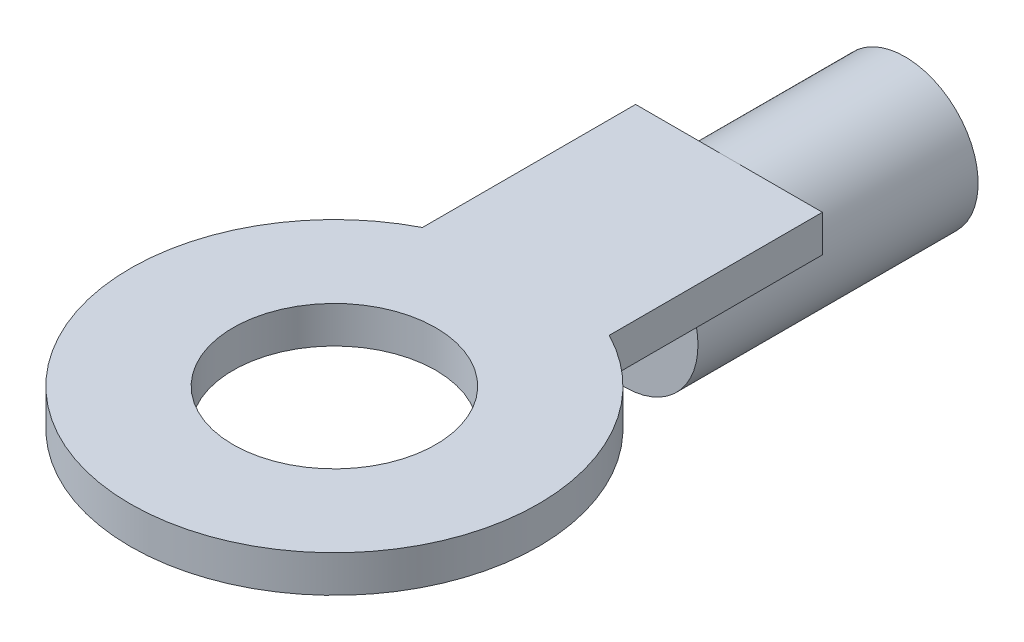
ISO-10303-21;
HEADER;
FILE_DESCRIPTION(('STEP AP214'),'2;1');
FILE_NAME('part.step','',(''),(''),'','','');
FILE_SCHEMA(('AUTOMOTIVE_DESIGN { 1 0 10303 214 1 1 1 1 }'));
ENDSEC;
DATA;
#1=APPLICATION_CONTEXT('core data for automotive mechanical design processes');
#2=APPLICATION_PROTOCOL_DEFINITION('international standard','automotive_design',2000,#1);
#3=PRODUCT_CONTEXT('',#1,'mechanical');
#4=PRODUCT('Part','Part','',(#3));
#5=PRODUCT_RELATED_PRODUCT_CATEGORY('part','',(#4));
#6=PRODUCT_DEFINITION_FORMATION('','',#4);
#7=PRODUCT_DEFINITION_CONTEXT('part definition',#1,'design');
#8=PRODUCT_DEFINITION('design','',#6,#7);
#9=PRODUCT_DEFINITION_SHAPE('','',#8);
#10=(LENGTH_UNIT() NAMED_UNIT(*) SI_UNIT(.MILLI.,.METRE.));
#11=(NAMED_UNIT(*) PLANE_ANGLE_UNIT() SI_UNIT($,.RADIAN.));
#12=(NAMED_UNIT(*) SI_UNIT($,.STERADIAN.) SOLID_ANGLE_UNIT());
#13=UNCERTAINTY_MEASURE_WITH_UNIT(LENGTH_MEASURE(1.E-05),#10,'distance_accuracy_value','');
#14=(GEOMETRIC_REPRESENTATION_CONTEXT(3) GLOBAL_UNCERTAINTY_ASSIGNED_CONTEXT((#13)) GLOBAL_UNIT_ASSIGNED_CONTEXT((#10,
#11,#12)) REPRESENTATION_CONTEXT('',''));
#15=CARTESIAN_POINT('',(0.,0.,0.));
#16=DIRECTION('',(0.,0.,1.));
#17=DIRECTION('',(1.,0.,0.));
#18=AXIS2_PLACEMENT_3D('',#15,#16,#17);
#19=CARTESIAN_POINT('',(0.,-36.565,7.33));
#20=DIRECTION('',(0.,0.,-1.));
#21=DIRECTION('',(-1.,0.,0.));
#22=AXIS2_PLACEMENT_3D('',#19,#20,#21);
#23=CYLINDRICAL_SURFACE('',#22,0.775);
#24=CARTESIAN_POINT('',(0.,-36.565,7.33));
#25=DIRECTION('',(0.,0.,-1.));
#26=DIRECTION('',(-1.,0.,0.));
#27=AXIS2_PLACEMENT_3D('',#24,#25,#26);
#28=CIRCLE('',#27,0.775);
#29=CARTESIAN_POINT('',(-2.67147183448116E-08,-35.79,7.33));
#30=VERTEX_POINT('',#29);
#31=CARTESIAN_POINT('',(-0.775,-36.565,7.33));
#32=VERTEX_POINT('',#31);
#33=EDGE_CURVE('E58',#30,#32,#28,.T.);
#34=ORIENTED_EDGE('',*,*,#33,.F.);
#35=CARTESIAN_POINT('',(0.,-36.565,7.33));
#36=DIRECTION('',(0.,0.,-1.));
#37=DIRECTION('',(-1.,0.,0.));
#38=AXIS2_PLACEMENT_3D('',#35,#36,#37);
#39=CIRCLE('',#38,0.775);
#40=EDGE_CURVE('E20',#32,#30,#39,.T.);
#41=ORIENTED_EDGE('',*,*,#40,.F.);
#42=DIRECTION('',(0.,0.,-1.));
#43=VECTOR('',#42,1.);
#44=CARTESIAN_POINT('',(-0.775,-36.565,7.33));
#45=LINE('',#44,#43);
#46=CARTESIAN_POINT('',(-0.775,-36.565,1.33));
#47=VERTEX_POINT('',#46);
#48=EDGE_CURVE('E133',#32,#47,#45,.T.);
#49=ORIENTED_EDGE('',*,*,#48,.T.);
#50=CARTESIAN_POINT('',(0.,-36.565,1.33));
#51=DIRECTION('',(0.,0.,-1.));
#52=DIRECTION('',(-1.,0.,0.));
#53=AXIS2_PLACEMENT_3D('',#50,#51,#52);
#54=CIRCLE('',#53,0.775);
#55=EDGE_CURVE('E135',#47,#47,#54,.T.);
#56=ORIENTED_EDGE('',*,*,#55,.T.);
#57=ORIENTED_EDGE('',*,*,#48,.F.);
#58=EDGE_LOOP('',(#34,#41,#49,#56,#57));
#59=FACE_BOUND('',#58,.T.);
#60=ADVANCED_FACE('F16',(#59),#23,.F.);
#61=CARTESIAN_POINT('',(0.,-36.565,1.33));
#62=DIRECTION('',(0.,0.,-1.));
#63=DIRECTION('',(0.,-1.,0.));
#64=AXIS2_PLACEMENT_3D('',#61,#62,#63);
#65=PLANE('',#64);
#66=ORIENTED_EDGE('',*,*,#55,.F.);
#67=EDGE_LOOP('',(#66));
#68=FACE_BOUND('',#67,.T.);
#69=CARTESIAN_POINT('',(0.,-36.565,1.33));
#70=DIRECTION('',(0.,0.,-1.));
#71=DIRECTION('',(-1.,0.,0.));
#72=AXIS2_PLACEMENT_3D('',#69,#70,#71);
#73=CIRCLE('',#72,1.565);
#74=CARTESIAN_POINT('',(-1.565,-36.565,1.33));
#75=VERTEX_POINT('',#74);
#76=EDGE_CURVE('E141',#75,#75,#73,.T.);
#77=ORIENTED_EDGE('',*,*,#76,.T.);
#78=EDGE_LOOP('',(#77));
#79=FACE_BOUND('',#78,.T.);
#80=ADVANCED_FACE('F138',(#68,#79),#65,.T.);
#81=CARTESIAN_POINT('',(0.,-35.79,13.55));
#82=DIRECTION('',(0.,1.,0.));
#83=DIRECTION('',(1.,0.,0.));
#84=AXIS2_PLACEMENT_3D('',#81,#82,#83);
#85=PLANE('',#84);
#86=CARTESIAN_POINT('',(0.,-35.79,13.55));
#87=DIRECTION('',(0.,1.,0.));
#88=DIRECTION('',(0.,0.,-1.));
#89=AXIS2_PLACEMENT_3D('',#86,#87,#88);
#90=CIRCLE('',#89,2.17);
#91=CARTESIAN_POINT('',(0.,-35.79,11.38));
#92=VERTEX_POINT('',#91);
#93=EDGE_CURVE('E146',#92,#92,#90,.T.);
#94=ORIENTED_EDGE('',*,*,#93,.T.);
#95=EDGE_LOOP('',(#94));
#96=FACE_BOUND('',#95,.T.);
#97=DIRECTION('',(-1.,0.,0.));
#98=VECTOR('',#97,1.);
#99=CARTESIAN_POINT('',(2.,-35.79,5.1));
#100=LINE('',#99,#98);
#101=CARTESIAN_POINT('',(-1.359632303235,-35.79,5.1));
#102=VERTEX_POINT('',#101);
#103=CARTESIAN_POINT('',(-2.,-35.79,5.1));
#104=VERTEX_POINT('',#103);
#105=EDGE_CURVE('E155',#102,#104,#100,.T.);
#106=ORIENTED_EDGE('',*,*,#105,.F.);
#107=DIRECTION('',(0.,0.,-1.));
#108=VECTOR('',#107,1.);
#109=CARTESIAN_POINT('',(-1.359632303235,-35.79,7.33));
#110=LINE('',#109,#108);
#111=CARTESIAN_POINT('',(-1.359632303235,-35.79,7.33));
#112=VERTEX_POINT('',#111);
#113=EDGE_CURVE('E158',#112,#102,#110,.T.);
#114=ORIENTED_EDGE('',*,*,#113,.F.);
#115=CARTESIAN_POINT('',(-2.67147183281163E-08,-35.79,7.33));
#116=CARTESIAN_POINT('',(-1.359632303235,-35.79,7.33));
#117=B_SPLINE_CURVE_WITH_KNOTS('',1,(#115,#116),.UNSPECIFIED.,.F.,.F.,(2,2),(0.,1.),.UNSPECIFIED.);
#118=EDGE_CURVE('E10',#30,#112,#117,.T.);
#119=ORIENTED_EDGE('',*,*,#118,.F.);
#120=CARTESIAN_POINT('',(1.359632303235,-35.79,7.33));
#121=CARTESIAN_POINT('',(-2.67147183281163E-08,-35.79,7.33));
#122=B_SPLINE_CURVE_WITH_KNOTS('',1,(#120,#121),.UNSPECIFIED.,.F.,.F.,(2,2),(0.,1.),.UNSPECIFIED.);
#123=CARTESIAN_POINT('',(1.35963230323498,-35.79,7.33));
#124=VERTEX_POINT('',#123);
#125=EDGE_CURVE('E233',#124,#30,#122,.T.);
#126=ORIENTED_EDGE('',*,*,#125,.F.);
#127=DIRECTION('',(0.,0.,-1.));
#128=VECTOR('',#127,1.);
#129=CARTESIAN_POINT('',(1.359632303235,-35.79,7.33));
#130=LINE('',#129,#128);
#131=CARTESIAN_POINT('',(1.359632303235,-35.79,5.1));
#132=VERTEX_POINT('',#131);
#133=EDGE_CURVE('E164',#124,#132,#130,.T.);
#134=ORIENTED_EDGE('',*,*,#133,.T.);
#135=DIRECTION('',(-1.,0.,0.));
#136=VECTOR('',#135,1.);
#137=CARTESIAN_POINT('',(2.,-35.79,5.1));
#138=LINE('',#137,#136);
#139=CARTESIAN_POINT('',(2.,-35.79,5.1));
#140=VERTEX_POINT('',#139);
#141=EDGE_CURVE('E159',#140,#132,#138,.T.);
#142=ORIENTED_EDGE('',*,*,#141,.F.);
#143=DIRECTION('',(0.,0.,-1.));
#144=VECTOR('',#143,1.);
#145=CARTESIAN_POINT('',(2.,-35.79,10.6));
#146=LINE('',#145,#144);
#147=CARTESIAN_POINT('',(2.,-35.79,9.664527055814));
#148=VERTEX_POINT('',#147);
#149=EDGE_CURVE('E163',#148,#140,#146,.T.);
#150=ORIENTED_EDGE('',*,*,#149,.F.);
#151=CARTESIAN_POINT('',(0.,-35.79,13.55));
#152=DIRECTION('',(0.,1.,0.));
#153=DIRECTION('',(0.,0.,-1.));
#154=AXIS2_PLACEMENT_3D('',#151,#152,#153);
#155=CIRCLE('',#154,4.37);
#156=CARTESIAN_POINT('',(-2.,-35.79,9.664527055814));
#157=VERTEX_POINT('',#156);
#158=EDGE_CURVE('E168',#157,#148,#155,.T.);
#159=ORIENTED_EDGE('',*,*,#158,.F.);
#160=DIRECTION('',(0.,0.,-1.));
#161=VECTOR('',#160,1.);
#162=CARTESIAN_POINT('',(-2.,-35.79,10.6));
#163=LINE('',#162,#161);
#164=EDGE_CURVE('E172',#157,#104,#163,.T.);
#165=ORIENTED_EDGE('',*,*,#164,.T.);
#166=EDGE_LOOP('',(#106,#114,#119,#126,#134,#142,#150,#159,#165));
#167=FACE_BOUND('',#166,.T.);
#168=ADVANCED_FACE('F242',(#96,#167),#85,.F.);
#169=CARTESIAN_POINT('',(0.,-35.79,13.55));
#170=DIRECTION('',(0.,1.,0.));
#171=DIRECTION('',(0.,0.,-1.));
#172=AXIS2_PLACEMENT_3D('',#169,#170,#171);
#173=CYLINDRICAL_SURFACE('',#172,2.17);
#174=DIRECTION('',(0.,1.,0.));
#175=VECTOR('',#174,1.);
#176=CARTESIAN_POINT('',(0.,-35.79,11.38));
#177=LINE('',#176,#175);
#178=CARTESIAN_POINT('',(0.,-35.,11.38));
#179=VERTEX_POINT('',#178);
#180=EDGE_CURVE('E176',#92,#179,#177,.T.);
#181=ORIENTED_EDGE('',*,*,#180,.F.);
#182=ORIENTED_EDGE('',*,*,#93,.F.);
#183=ORIENTED_EDGE('',*,*,#180,.T.);
#184=CARTESIAN_POINT('',(0.,-35.,13.55));
#185=DIRECTION('',(0.,1.,0.));
#186=DIRECTION('',(0.,0.,-1.));
#187=AXIS2_PLACEMENT_3D('',#184,#185,#186);
#188=CIRCLE('',#187,2.17);
#189=EDGE_CURVE('E179',#179,#179,#188,.T.);
#190=ORIENTED_EDGE('',*,*,#189,.T.);
#191=EDGE_LOOP('',(#181,#182,#183,#190));
#192=FACE_BOUND('',#191,.T.);
#193=ADVANCED_FACE('F272',(#192),#173,.F.);
#194=CARTESIAN_POINT('',(0.,-36.565,7.33));
#195=DIRECTION('',(0.,0.,-1.));
#196=DIRECTION('',(-1.,0.,0.));
#197=AXIS2_PLACEMENT_3D('',#194,#195,#196);
#198=CYLINDRICAL_SURFACE('',#197,1.565);
#199=DIRECTION('',(0.,0.,-1.));
#200=VECTOR('',#199,1.);
#201=CARTESIAN_POINT('',(-1.565,-36.565,7.33));
#202=LINE('',#201,#200);
#203=CARTESIAN_POINT('',(-1.565,-36.565,7.33));
#204=VERTEX_POINT('',#203);
#205=EDGE_CURVE('E183',#204,#75,#202,.T.);
#206=ORIENTED_EDGE('',*,*,#205,.T.);
#207=ORIENTED_EDGE('',*,*,#76,.F.);
#208=ORIENTED_EDGE('',*,*,#205,.F.);
#209=CARTESIAN_POINT('',(0.,-36.565,7.33));
#210=DIRECTION('',(0.,0.,-1.));
#211=DIRECTION('',(-1.,0.,0.));
#212=AXIS2_PLACEMENT_3D('',#209,#210,#211);
#213=CIRCLE('',#212,1.565);
#214=EDGE_CURVE('E27',#204,#112,#213,.T.);
#215=ORIENTED_EDGE('',*,*,#214,.T.);
#216=ORIENTED_EDGE('',*,*,#113,.T.);
#217=CARTESIAN_POINT('',(0.,-36.565,5.1));
#218=DIRECTION('',(0.,0.,-1.));
#219=DIRECTION('',(-1.,0.,0.));
#220=AXIS2_PLACEMENT_3D('',#217,#218,#219);
#221=CIRCLE('',#220,1.565);
#222=CARTESIAN_POINT('',(0.,-35.,5.1));
#223=VERTEX_POINT('',#222);
#224=EDGE_CURVE('E184',#102,#223,#221,.T.);
#225=ORIENTED_EDGE('',*,*,#224,.T.);
#226=CARTESIAN_POINT('',(0.,-36.565,5.1));
#227=DIRECTION('',(0.,0.,-1.));
#228=DIRECTION('',(-1.,0.,0.));
#229=AXIS2_PLACEMENT_3D('',#226,#227,#228);
#230=CIRCLE('',#229,1.565);
#231=EDGE_CURVE('E187',#223,#132,#230,.T.);
#232=ORIENTED_EDGE('',*,*,#231,.T.);
#233=ORIENTED_EDGE('',*,*,#133,.F.);
#234=CARTESIAN_POINT('',(0.,-36.565,7.33));
#235=DIRECTION('',(0.,0.,-1.));
#236=DIRECTION('',(-1.,0.,0.));
#237=AXIS2_PLACEMENT_3D('',#234,#235,#236);
#238=CIRCLE('',#237,1.565);
#239=EDGE_CURVE('E230',#124,#204,#238,.T.);
#240=ORIENTED_EDGE('',*,*,#239,.T.);
#241=EDGE_LOOP('',(#206,#207,#208,#215,#216,#225,#232,#233,#240));
#242=FACE_BOUND('',#241,.T.);
#243=ADVANCED_FACE('F246',(#242),#198,.T.);
#244=CARTESIAN_POINT('',(2.,-35.,10.6));
#245=DIRECTION('',(0.,1.,0.));
#246=DIRECTION('',(1.,0.,0.));
#247=AXIS2_PLACEMENT_3D('',#244,#245,#246);
#248=PLANE('',#247);
#249=ORIENTED_EDGE('',*,*,#189,.F.);
#250=EDGE_LOOP('',(#249));
#251=FACE_BOUND('',#250,.T.);
#252=DIRECTION('',(0.,0.,-1.));
#253=VECTOR('',#252,1.);
#254=CARTESIAN_POINT('',(-2.,-35.,10.6));
#255=LINE('',#254,#253);
#256=CARTESIAN_POINT('',(-2.,-35.,9.664527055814));
#257=VERTEX_POINT('',#256);
#258=CARTESIAN_POINT('',(-2.,-35.,5.1));
#259=VERTEX_POINT('',#258);
#260=EDGE_CURVE('E70',#257,#259,#255,.T.);
#261=ORIENTED_EDGE('',*,*,#260,.F.);
#262=CARTESIAN_POINT('',(0.,-35.,13.55));
#263=DIRECTION('',(0.,1.,0.));
#264=DIRECTION('',(0.,0.,-1.));
#265=AXIS2_PLACEMENT_3D('',#262,#263,#264);
#266=CIRCLE('',#265,4.37);
#267=CARTESIAN_POINT('',(2.,-35.,9.664527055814));
#268=VERTEX_POINT('',#267);
#269=EDGE_CURVE('E193',#257,#268,#266,.T.);
#270=ORIENTED_EDGE('',*,*,#269,.T.);
#271=DIRECTION('',(0.,0.,-1.));
#272=VECTOR('',#271,1.);
#273=CARTESIAN_POINT('',(2.,-35.,10.6));
#274=LINE('',#273,#272);
#275=CARTESIAN_POINT('',(2.,-35.,5.1));
#276=VERTEX_POINT('',#275);
#277=EDGE_CURVE('E80',#268,#276,#274,.T.);
#278=ORIENTED_EDGE('',*,*,#277,.T.);
#279=DIRECTION('',(-1.,0.,0.));
#280=VECTOR('',#279,1.);
#281=CARTESIAN_POINT('',(2.,-35.,5.1));
#282=LINE('',#281,#280);
#283=EDGE_CURVE('E198',#276,#223,#282,.T.);
#284=ORIENTED_EDGE('',*,*,#283,.T.);
#285=DIRECTION('',(-1.,0.,0.));
#286=VECTOR('',#285,1.);
#287=CARTESIAN_POINT('',(2.,-35.,5.1));
#288=LINE('',#287,#286);
#289=EDGE_CURVE('E201',#223,#259,#288,.T.);
#290=ORIENTED_EDGE('',*,*,#289,.T.);
#291=EDGE_LOOP('',(#261,#270,#278,#284,#290));
#292=FACE_BOUND('',#291,.T.);
#293=ADVANCED_FACE('F262',(#251,#292),#248,.T.);
#294=CARTESIAN_POINT('',(2.,-35.79,5.1));
#295=DIRECTION('',(0.,0.,-1.));
#296=DIRECTION('',(0.,-1.,0.));
#297=AXIS2_PLACEMENT_3D('',#294,#295,#296);
#298=PLANE('',#297);
#299=ORIENTED_EDGE('',*,*,#289,.F.);
#300=ORIENTED_EDGE('',*,*,#224,.F.);
#301=ORIENTED_EDGE('',*,*,#105,.T.);
#302=DIRECTION('',(0.,1.,0.));
#303=VECTOR('',#302,1.);
#304=CARTESIAN_POINT('',(-2.,-35.79,5.1));
#305=LINE('',#304,#303);
#306=EDGE_CURVE('E204',#104,#259,#305,.T.);
#307=ORIENTED_EDGE('',*,*,#306,.T.);
#308=EDGE_LOOP('',(#299,#300,#301,#307));
#309=FACE_BOUND('',#308,.T.);
#310=ADVANCED_FACE('F261',(#309),#298,.T.);
#311=CARTESIAN_POINT('',(2.,-35.79,5.1));
#312=DIRECTION('',(0.,0.,-1.));
#313=DIRECTION('',(0.,-1.,0.));
#314=AXIS2_PLACEMENT_3D('',#311,#312,#313);
#315=PLANE('',#314);
#316=ORIENTED_EDGE('',*,*,#283,.F.);
#317=DIRECTION('',(0.,1.,0.));
#318=VECTOR('',#317,1.);
#319=CARTESIAN_POINT('',(2.,-35.79,5.1));
#320=LINE('',#319,#318);
#321=EDGE_CURVE('E208',#140,#276,#320,.T.);
#322=ORIENTED_EDGE('',*,*,#321,.F.);
#323=ORIENTED_EDGE('',*,*,#141,.T.);
#324=ORIENTED_EDGE('',*,*,#231,.F.);
#325=EDGE_LOOP('',(#316,#322,#323,#324));
#326=FACE_BOUND('',#325,.T.);
#327=ADVANCED_FACE('F250',(#326),#315,.T.);
#328=CARTESIAN_POINT('',(2.,-35.79,10.6));
#329=DIRECTION('',(-1.,0.,0.));
#330=DIRECTION('',(0.,0.,1.));
#331=AXIS2_PLACEMENT_3D('',#328,#329,#330);
#332=PLANE('',#331);
#333=ORIENTED_EDGE('',*,*,#321,.T.);
#334=ORIENTED_EDGE('',*,*,#277,.F.);
#335=DIRECTION('',(0.,1.,0.));
#336=VECTOR('',#335,1.);
#337=CARTESIAN_POINT('',(2.,-35.79,9.664527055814));
#338=LINE('',#337,#336);
#339=EDGE_CURVE('E212',#148,#268,#338,.T.);
#340=ORIENTED_EDGE('',*,*,#339,.F.);
#341=ORIENTED_EDGE('',*,*,#149,.T.);
#342=EDGE_LOOP('',(#333,#334,#340,#341));
#343=FACE_BOUND('',#342,.T.);
#344=ADVANCED_FACE('F252',(#343),#332,.F.);
#345=CARTESIAN_POINT('',(0.,-35.79,13.55));
#346=DIRECTION('',(0.,1.,0.));
#347=DIRECTION('',(0.,0.,-1.));
#348=AXIS2_PLACEMENT_3D('',#345,#346,#347);
#349=CYLINDRICAL_SURFACE('',#348,4.37);
#350=ORIENTED_EDGE('',*,*,#269,.F.);
#351=DIRECTION('',(0.,1.,0.));
#352=VECTOR('',#351,1.);
#353=CARTESIAN_POINT('',(-2.,-35.79,9.664527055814));
#354=LINE('',#353,#352);
#355=EDGE_CURVE('E216',#157,#257,#354,.T.);
#356=ORIENTED_EDGE('',*,*,#355,.F.);
#357=ORIENTED_EDGE('',*,*,#158,.T.);
#358=ORIENTED_EDGE('',*,*,#339,.T.);
#359=EDGE_LOOP('',(#350,#356,#357,#358));
#360=FACE_BOUND('',#359,.T.);
#361=ADVANCED_FACE('F258',(#360),#349,.T.);
#362=CARTESIAN_POINT('',(-2.,-35.79,10.6));
#363=DIRECTION('',(-1.,0.,0.));
#364=DIRECTION('',(0.,0.,1.));
#365=AXIS2_PLACEMENT_3D('',#362,#363,#364);
#366=PLANE('',#365);
#367=ORIENTED_EDGE('',*,*,#164,.F.);
#368=ORIENTED_EDGE('',*,*,#355,.T.);
#369=ORIENTED_EDGE('',*,*,#260,.T.);
#370=ORIENTED_EDGE('',*,*,#306,.F.);
#371=EDGE_LOOP('',(#367,#368,#369,#370));
#372=FACE_BOUND('',#371,.T.);
#373=ADVANCED_FACE('F18',(#372),#366,.T.);
#374=CARTESIAN_POINT('',(0.,-36.565,7.33));
#375=DIRECTION('',(0.,0.,-1.));
#376=DIRECTION('',(0.,-1.,0.));
#377=AXIS2_PLACEMENT_3D('',#374,#375,#376);
#378=PLANE('',#377);
#379=ORIENTED_EDGE('',*,*,#40,.T.);
#380=ORIENTED_EDGE('',*,*,#118,.T.);
#381=ORIENTED_EDGE('',*,*,#214,.F.);
#382=ORIENTED_EDGE('',*,*,#239,.F.);
#383=ORIENTED_EDGE('',*,*,#125,.T.);
#384=ORIENTED_EDGE('',*,*,#33,.T.);
#385=EDGE_LOOP('',(#379,#380,#381,#382,#383,#384));
#386=FACE_BOUND('',#385,.T.);
#387=ADVANCED_FACE('F238',(#386),#378,.F.);
#388=CLOSED_SHELL('',(#60,#80,#168,#193,#243,#293,#310,#327,#344,#361,#373,#387));
#389=MANIFOLD_SOLID_BREP('B1',#388);
#390=ADVANCED_BREP_SHAPE_REPRESENTATION('',(#18,#389),#14);
#391=SHAPE_DEFINITION_REPRESENTATION(#9,#390);
ENDSEC;
END-ISO-10303-21;
